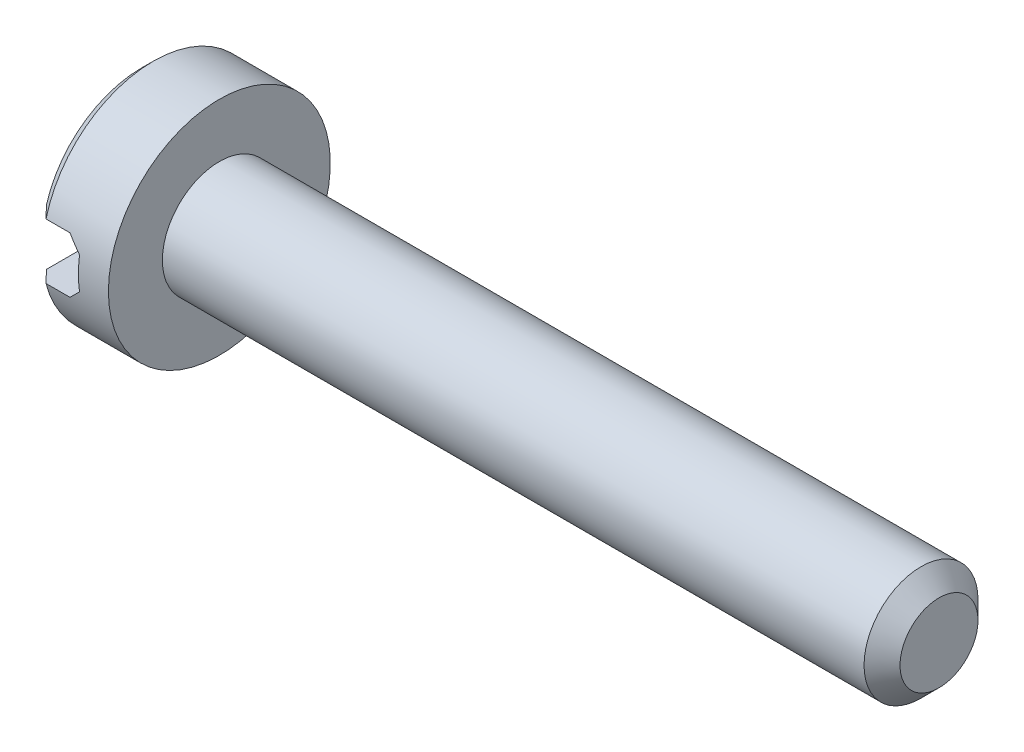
ISO-10303-21;
HEADER;
FILE_DESCRIPTION(('STEP AP214'),'2;1');
FILE_NAME('part.step','',(''),(''),'','','');
FILE_SCHEMA(('AUTOMOTIVE_DESIGN { 1 0 10303 214 1 1 1 1 }'));
ENDSEC;
DATA;
#1=APPLICATION_CONTEXT('core data for automotive mechanical design processes');
#2=APPLICATION_PROTOCOL_DEFINITION('international standard','automotive_design',2000,#1);
#3=PRODUCT_CONTEXT('',#1,'mechanical');
#4=PRODUCT('Part','Part','',(#3));
#5=PRODUCT_RELATED_PRODUCT_CATEGORY('part','',(#4));
#6=PRODUCT_DEFINITION_FORMATION('','',#4);
#7=PRODUCT_DEFINITION_CONTEXT('part definition',#1,'design');
#8=PRODUCT_DEFINITION('design','',#6,#7);
#9=PRODUCT_DEFINITION_SHAPE('','',#8);
#10=(LENGTH_UNIT() NAMED_UNIT(*) SI_UNIT(.MILLI.,.METRE.));
#11=(NAMED_UNIT(*) PLANE_ANGLE_UNIT() SI_UNIT($,.RADIAN.));
#12=(NAMED_UNIT(*) SI_UNIT($,.STERADIAN.) SOLID_ANGLE_UNIT());
#13=UNCERTAINTY_MEASURE_WITH_UNIT(LENGTH_MEASURE(1.E-05),#10,'distance_accuracy_value','');
#14=(GEOMETRIC_REPRESENTATION_CONTEXT(3) GLOBAL_UNCERTAINTY_ASSIGNED_CONTEXT((#13)) GLOBAL_UNIT_ASSIGNED_CONTEXT((#10,
#11,#12)) REPRESENTATION_CONTEXT('',''));
#15=CARTESIAN_POINT('',(0.,0.,0.));
#16=DIRECTION('',(0.,0.,1.));
#17=DIRECTION('',(1.,0.,0.));
#18=AXIS2_PLACEMENT_3D('',#15,#16,#17);
#19=CARTESIAN_POINT('',(1.3,1.85,0.));
#20=DIRECTION('',(-1.,0.,0.));
#21=DIRECTION('',(0.,0.,1.));
#22=AXIS2_PLACEMENT_3D('',#19,#20,#21);
#23=PLANE('',#22);
#24=CARTESIAN_POINT('',(1.3,0.,0.));
#25=DIRECTION('',(-1.,0.,0.));
#26=DIRECTION('',(0.,0.,1.));
#27=AXIS2_PLACEMENT_3D('',#24,#25,#26);
#28=CIRCLE('',#27,1.85);
#29=CARTESIAN_POINT('',(1.3,0.,1.85));
#30=VERTEX_POINT('',#29);
#31=EDGE_CURVE('E111',#30,#30,#28,.T.);
#32=ORIENTED_EDGE('',*,*,#31,.F.);
#33=EDGE_LOOP('',(#32));
#34=FACE_BOUND('',#33,.T.);
#35=CARTESIAN_POINT('',(1.3,0.,0.));
#36=DIRECTION('',(-1.,0.,0.));
#37=DIRECTION('',(0.,0.,1.));
#38=AXIS2_PLACEMENT_3D('',#35,#36,#37);
#39=CIRCLE('',#38,0.95);
#40=CARTESIAN_POINT('',(1.3,0.,0.95));
#41=VERTEX_POINT('',#40);
#42=EDGE_CURVE('E150',#41,#41,#39,.F.);
#43=ORIENTED_EDGE('',*,*,#42,.F.);
#44=EDGE_LOOP('',(#43));
#45=FACE_BOUND('',#44,.T.);
#46=ADVANCED_FACE('F37',(#34,#45),#23,.F.);
#47=CARTESIAN_POINT('',(0.2,0.,0.));
#48=DIRECTION('',(1.,0.,0.));
#49=DIRECTION('',(0.,0.,-1.));
#50=AXIS2_PLACEMENT_3D('',#47,#48,#49);
#51=CONICAL_SURFACE('',#50,1.85,0.785398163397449);
#52=CARTESIAN_POINT('',(0.2,0.,0.));
#53=DIRECTION('',(-1.,0.,0.));
#54=DIRECTION('',(0.,0.,1.));
#55=AXIS2_PLACEMENT_3D('',#52,#53,#54);
#56=CIRCLE('',#55,1.85);
#57=CARTESIAN_POINT('',(0.2,0.465549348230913,1.79046468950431));
#58=VERTEX_POINT('',#57);
#59=CARTESIAN_POINT('',(0.2,0.465549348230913,-1.79046468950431));
#60=VERTEX_POINT('',#59);
#61=EDGE_CURVE('E132',#58,#60,#56,.T.);
#62=ORIENTED_EDGE('',*,*,#61,.T.);
#63=CARTESIAN_POINT('',(2.42344087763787,0.465549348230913,-4.04674985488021));
#64=CARTESIAN_POINT('',(2.31422073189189,0.465549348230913,-3.9368070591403));
#65=CARTESIAN_POINT('',(2.20502763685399,0.465549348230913,-3.82683737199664));
#66=CARTESIAN_POINT('',(1.98669704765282,0.465549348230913,-3.60680197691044));
#67=CARTESIAN_POINT('',(1.87755956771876,0.465549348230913,-3.49673625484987));
#68=CARTESIAN_POINT('',(1.65894933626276,0.465549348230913,-3.27607034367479));
#69=CARTESIAN_POINT('',(1.54947697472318,0.465549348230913,-3.16546976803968));
#70=CARTESIAN_POINT('',(1.33068893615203,0.465549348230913,-2.94415427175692));
#71=CARTESIAN_POINT('',(1.22137323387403,0.465549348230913,-2.83343937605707));
#72=CARTESIAN_POINT('',(0.94158553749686,0.465549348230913,-2.54959909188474));
#73=CARTESIAN_POINT('',(0.771245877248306,0.465549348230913,-2.37634297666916));
#74=CARTESIAN_POINT('',(0.516315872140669,0.465549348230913,-2.11577452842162));
#75=CARTESIAN_POINT('',(0.431406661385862,0.465549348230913,-2.02877427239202));
#76=CARTESIAN_POINT('',(0.261908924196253,0.465549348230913,-1.85447495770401));
#77=CARTESIAN_POINT('',(0.177320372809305,0.465549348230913,-1.76717592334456));
#78=CARTESIAN_POINT('',(0.00893926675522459,0.465549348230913,-1.59244630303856));
#79=CARTESIAN_POINT('',(-0.0748550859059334,0.465549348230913,-1.50501745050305));
#80=CARTESIAN_POINT('',(-0.241707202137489,0.465549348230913,-1.32940591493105));
#81=CARTESIAN_POINT('',(-0.324764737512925,0.465549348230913,-1.24122301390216));
#82=CARTESIAN_POINT('',(-0.448249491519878,0.465549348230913,-1.10803308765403));
#83=CARTESIAN_POINT('',(-0.4892012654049,0.465549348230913,-1.06351303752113));
#84=CARTESIAN_POINT('',(-0.570603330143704,0.465549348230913,-0.974017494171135));
#85=CARTESIAN_POINT('',(-0.61105363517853,0.465549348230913,-0.929042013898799));
#86=CARTESIAN_POINT('',(-0.691196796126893,0.465549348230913,-0.838458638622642));
#87=CARTESIAN_POINT('',(-0.730890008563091,0.465549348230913,-0.792851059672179));
#88=CARTESIAN_POINT('',(-0.809128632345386,0.465549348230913,-0.700664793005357));
#89=CARTESIAN_POINT('',(-0.847674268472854,0.465549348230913,-0.654086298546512));
#90=CARTESIAN_POINT('',(-0.899367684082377,0.465549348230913,-0.588920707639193));
#91=CARTESIAN_POINT('',(-0.913355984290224,0.465549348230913,-0.571002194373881));
#92=CARTESIAN_POINT('',(-0.940978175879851,0.465549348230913,-0.53489334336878));
#93=CARTESIAN_POINT('',(-0.954612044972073,0.465549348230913,-0.516702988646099));
#94=CARTESIAN_POINT('',(-0.994922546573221,0.465549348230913,-0.461548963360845));
#95=CARTESIAN_POINT('',(-1.02093788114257,0.465549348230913,-0.424089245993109));
#96=CARTESIAN_POINT('',(-1.06919063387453,0.465549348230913,-0.348468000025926));
#97=CARTESIAN_POINT('',(-1.09152270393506,0.465549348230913,-0.310367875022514));
#98=CARTESIAN_POINT('',(-1.13109948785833,0.465549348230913,-0.231663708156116));
#99=CARTESIAN_POINT('',(-1.1483700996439,0.465549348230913,-0.191073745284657));
#100=CARTESIAN_POINT('',(-1.16937161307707,0.465549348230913,-0.122137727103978));
#101=CARTESIAN_POINT('',(-1.17573754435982,0.465549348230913,-0.0946292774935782));
#102=CARTESIAN_POINT('',(-1.18362415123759,0.465549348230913,-0.0389959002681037));
#103=CARTESIAN_POINT('',(-1.1851644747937,0.465549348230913,-0.0108739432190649));
#104=CARTESIAN_POINT('',(-1.18310496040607,0.465549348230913,0.0451823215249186));
#105=CARTESIAN_POINT('',(-1.17950248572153,0.465549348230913,0.0731165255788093));
#106=CARTESIAN_POINT('',(-1.16789735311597,0.465549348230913,0.128135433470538));
#107=CARTESIAN_POINT('',(-1.15987428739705,0.465549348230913,0.155215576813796));
#108=CARTESIAN_POINT('',(-1.13863829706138,0.465549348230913,0.213647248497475));
#109=CARTESIAN_POINT('',(-1.12469509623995,0.465549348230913,0.244723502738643));
#110=CARTESIAN_POINT('',(-1.09383840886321,0.465549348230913,0.305390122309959));
#111=CARTESIAN_POINT('',(-1.07691840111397,0.465549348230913,0.334977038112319));
#112=CARTESIAN_POINT('',(-1.04106417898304,0.465549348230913,0.393185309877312));
#113=CARTESIAN_POINT('',(-1.02211606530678,0.465549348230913,0.421797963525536));
#114=CARTESIAN_POINT('',(-0.982981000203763,0.465549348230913,0.478106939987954));
#115=CARTESIAN_POINT('',(-0.962795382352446,0.465549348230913,0.505804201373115));
#116=CARTESIAN_POINT('',(-0.919274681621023,0.465549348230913,0.563580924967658));
#117=CARTESIAN_POINT('',(-0.895838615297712,0.465549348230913,0.593583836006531));
#118=CARTESIAN_POINT('',(-0.848230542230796,0.465549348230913,0.65300190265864));
#119=CARTESIAN_POINT('',(-0.82405844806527,0.465549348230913,0.682416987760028));
#120=CARTESIAN_POINT('',(-0.750747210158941,0.465549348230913,0.770035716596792));
#121=CARTESIAN_POINT('',(-0.700832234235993,0.465549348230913,0.827588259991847));
#122=CARTESIAN_POINT('',(-0.599780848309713,0.465549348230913,0.941762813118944));
#123=CARTESIAN_POINT('',(-0.548642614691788,0.465549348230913,0.998383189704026));
#124=CARTESIAN_POINT('',(-0.445660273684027,0.465549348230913,1.11095186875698));
#125=CARTESIAN_POINT('',(-0.393816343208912,0.465549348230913,1.16690033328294));
#126=CARTESIAN_POINT('',(-0.289869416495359,0.465549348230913,1.27812634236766));
#127=CARTESIAN_POINT('',(-0.237768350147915,0.465549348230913,1.33340569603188));
#128=CARTESIAN_POINT('',(-0.133235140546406,0.465549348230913,1.44365673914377));
#129=CARTESIAN_POINT('',(-0.0808029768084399,0.465549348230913,1.49862840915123));
#130=CARTESIAN_POINT('',(0.0767523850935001,0.465549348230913,1.66311055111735));
#131=CARTESIAN_POINT('',(0.182225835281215,0.465549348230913,1.77228519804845));
#132=CARTESIAN_POINT('',(0.46430719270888,0.465549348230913,2.06287985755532));
#133=CARTESIAN_POINT('',(0.641375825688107,0.465549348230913,2.24385154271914));
#134=CARTESIAN_POINT('',(0.996250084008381,0.465549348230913,2.60519009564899));
#135=CARTESIAN_POINT('',(1.17405593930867,0.465549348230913,2.7855567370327));
#136=CARTESIAN_POINT('',(1.53035733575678,0.465549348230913,3.14622495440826));
#137=CARTESIAN_POINT('',(1.70885353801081,0.465549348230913,3.32652587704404));
#138=CARTESIAN_POINT('',(2.06602855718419,0.465549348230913,3.68681939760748));
#139=CARTESIAN_POINT('',(2.24470728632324,0.465549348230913,3.86681208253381));
#140=CARTESIAN_POINT('',(2.42344087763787,0.465549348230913,4.04674985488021));
#141=B_SPLINE_CURVE_WITH_KNOTS('',3,(#63,#64,#65,#66,#67,#68,#69,#70,#71,#72,#73,#74,#75,#76,
#77,#78,#79,#80,#81,#82,#83,#84,#85,#86,#87,#88,#89,#90,#91,#92,#93,#94,#95,#96,#97,#98,#99,
#100,#101,#102,#103,#104,#105,#106,#107,#108,#109,#110,#111,#112,#113,#114,#115,#116,#117,#118,
#119,#120,#121,#122,#123,#124,#125,#126,#127,#128,#129,#130,#131,#132,#133,#134,#135,#136,#137,
#138,#139,#140),.UNSPECIFIED.,.F.,.F.,(4,2,2,2,2,2,2,2,2,2,2,2,2,2,2,2,2,2,2,2,2,2,2,2,2,2,2,2,
2,2,2,2,2,2,2,2,2,2,4),(0.,0.46491734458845,0.929921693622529,1.39677290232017,1.86353771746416,
2.59243863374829,2.95714021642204,3.32181281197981,3.68511212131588,4.04852027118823,
4.22998896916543,4.41145252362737,4.59282840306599,4.77416851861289,4.84236041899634,
4.91055659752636,5.04728388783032,5.17961007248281,5.31124686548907,5.39561130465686,
5.47963179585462,5.56369538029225,5.64815033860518,5.75007643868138,5.85222867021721,
5.95513223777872,6.05792679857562,6.17212384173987,6.28633450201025,6.51484917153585,
6.74372884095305,6.97255215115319,7.20043854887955,7.42833918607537,7.88374058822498,
8.64329990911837,9.40311729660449,10.1642502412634,10.9251118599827),.UNSPECIFIED.);
#142=CARTESIAN_POINT('',(0.,0.465549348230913,-1.58296045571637));
#143=VERTEX_POINT('',#142);
#144=EDGE_CURVE('E128',#60,#143,#141,.T.);
#145=ORIENTED_EDGE('',*,*,#144,.T.);
#146=CARTESIAN_POINT('',(0.,0.,0.));
#147=DIRECTION('',(-1.,0.,0.));
#148=DIRECTION('',(0.,0.,1.));
#149=AXIS2_PLACEMENT_3D('',#146,#147,#148);
#150=CIRCLE('',#149,1.65);
#151=CARTESIAN_POINT('',(0.,0.465549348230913,1.58296045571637));
#152=VERTEX_POINT('',#151);
#153=EDGE_CURVE('E123',#152,#143,#150,.T.);
#154=ORIENTED_EDGE('',*,*,#153,.F.);
#155=EDGE_CURVE('E191',#152,#58,#141,.T.);
#156=ORIENTED_EDGE('',*,*,#155,.T.);
#157=EDGE_LOOP('',(#62,#145,#154,#156));
#158=FACE_BOUND('',#157,.T.);
#159=ADVANCED_FACE('F166',(#158),#51,.T.);
#160=CARTESIAN_POINT('',(0.,0.,0.));
#161=DIRECTION('',(1.,0.,0.));
#162=DIRECTION('',(0.,0.,-1.));
#163=AXIS2_PLACEMENT_3D('',#160,#161,#162);
#164=PLANE('',#163);
#165=ORIENTED_EDGE('',*,*,#153,.T.);
#166=DIRECTION('',(0.,0.,1.));
#167=VECTOR('',#166,1.);
#168=CARTESIAN_POINT('',(0.,0.465549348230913,0.));
#169=LINE('',#168,#167);
#170=EDGE_CURVE('E110',#143,#152,#169,.T.);
#171=ORIENTED_EDGE('',*,*,#170,.T.);
#172=EDGE_LOOP('',(#165,#171));
#173=FACE_BOUND('',#172,.T.);
#174=ADVANCED_FACE('F171',(#173),#164,.F.);
#175=CARTESIAN_POINT('',(0.,0.,0.));
#176=DIRECTION('',(-1.,0.,0.));
#177=DIRECTION('',(0.,0.,1.));
#178=AXIS2_PLACEMENT_3D('',#175,#176,#177);
#179=CYLINDRICAL_SURFACE('',#178,1.85);
#180=ORIENTED_EDGE('',*,*,#61,.F.);
#181=DIRECTION('',(-1.,0.,0.));
#182=VECTOR('',#181,1.);
#183=CARTESIAN_POINT('',(0.,0.465549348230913,1.79046468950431));
#184=LINE('',#183,#182);
#185=CARTESIAN_POINT('',(0.6,0.465549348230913,1.79046468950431));
#186=VERTEX_POINT('',#185);
#187=EDGE_CURVE('E198',#58,#186,#184,.F.);
#188=ORIENTED_EDGE('',*,*,#187,.T.);
#189=CARTESIAN_POINT('',(1.06554934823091,0.,0.));
#190=DIRECTION('',(0.707106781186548,0.707106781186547,0.));
#191=DIRECTION('',(-0.707106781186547,0.707106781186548,0.));
#192=AXIS2_PLACEMENT_3D('',#189,#190,#191);
#193=ELLIPSE('',#192,2.61629509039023,1.85);
#194=CARTESIAN_POINT('',(0.8,0.265549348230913,1.83084230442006));
#195=VERTEX_POINT('',#194);
#196=EDGE_CURVE('E149',#186,#195,#193,.T.);
#197=ORIENTED_EDGE('',*,*,#196,.T.);
#198=CARTESIAN_POINT('',(0.8,0.,0.));
#199=DIRECTION('',(1.,0.,0.));
#200=DIRECTION('',(0.,0.,-1.));
#201=AXIS2_PLACEMENT_3D('',#198,#199,#200);
#202=CIRCLE('',#201,1.85);
#203=CARTESIAN_POINT('',(0.8,-0.265549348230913,1.83084230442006));
#204=VERTEX_POINT('',#203);
#205=EDGE_CURVE('E60',#195,#204,#202,.T.);
#206=ORIENTED_EDGE('',*,*,#205,.T.);
#207=CARTESIAN_POINT('',(1.06554934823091,0.,0.));
#208=DIRECTION('',(0.707106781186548,-0.707106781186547,0.));
#209=DIRECTION('',(-0.707106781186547,-0.707106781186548,0.));
#210=AXIS2_PLACEMENT_3D('',#207,#208,#209);
#211=ELLIPSE('',#210,2.61629509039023,1.85);
#212=CARTESIAN_POINT('',(0.6,-0.465549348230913,1.79046468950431));
#213=VERTEX_POINT('',#212);
#214=EDGE_CURVE('E143',#204,#213,#211,.T.);
#215=ORIENTED_EDGE('',*,*,#214,.T.);
#216=DIRECTION('',(-1.,0.,0.));
#217=VECTOR('',#216,1.);
#218=CARTESIAN_POINT('',(0.,-0.465549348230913,1.79046468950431));
#219=LINE('',#218,#217);
#220=CARTESIAN_POINT('',(0.2,-0.465549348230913,1.79046468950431));
#221=VERTEX_POINT('',#220);
#222=EDGE_CURVE('E119',#213,#221,#219,.T.);
#223=ORIENTED_EDGE('',*,*,#222,.T.);
#224=CARTESIAN_POINT('',(0.2,-0.465549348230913,-1.79046468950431));
#225=VERTEX_POINT('',#224);
#226=EDGE_CURVE('E118',#225,#221,#56,.T.);
#227=ORIENTED_EDGE('',*,*,#226,.F.);
#228=DIRECTION('',(-1.,0.,0.));
#229=VECTOR('',#228,1.);
#230=CARTESIAN_POINT('',(0.,-0.465549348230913,-1.79046468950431));
#231=LINE('',#230,#229);
#232=CARTESIAN_POINT('',(0.6,-0.465549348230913,-1.79046468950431));
#233=VERTEX_POINT('',#232);
#234=EDGE_CURVE('E120',#225,#233,#231,.F.);
#235=ORIENTED_EDGE('',*,*,#234,.T.);
#236=CARTESIAN_POINT('',(0.8,-0.265549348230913,-1.83084230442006));
#237=VERTEX_POINT('',#236);
#238=EDGE_CURVE('E139',#233,#237,#211,.T.);
#239=ORIENTED_EDGE('',*,*,#238,.T.);
#240=CARTESIAN_POINT('',(0.8,0.265549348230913,-1.83084230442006));
#241=VERTEX_POINT('',#240);
#242=EDGE_CURVE('E142',#237,#241,#202,.T.);
#243=ORIENTED_EDGE('',*,*,#242,.T.);
#244=CARTESIAN_POINT('',(0.6,0.465549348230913,-1.79046468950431));
#245=VERTEX_POINT('',#244);
#246=EDGE_CURVE('E146',#241,#245,#193,.T.);
#247=ORIENTED_EDGE('',*,*,#246,.T.);
#248=DIRECTION('',(-1.,0.,0.));
#249=VECTOR('',#248,1.);
#250=CARTESIAN_POINT('',(0.,0.465549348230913,-1.79046468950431));
#251=LINE('',#250,#249);
#252=EDGE_CURVE('E124',#245,#60,#251,.T.);
#253=ORIENTED_EDGE('',*,*,#252,.T.);
#254=EDGE_LOOP('',(#180,#188,#197,#206,#215,#223,#227,#235,#239,#243,#247,#253));
#255=FACE_BOUND('',#254,.T.);
#256=ORIENTED_EDGE('',*,*,#31,.T.);
#257=EDGE_LOOP('',(#256));
#258=FACE_BOUND('',#257,.T.);
#259=ADVANCED_FACE('F177',(#255,#258),#179,.T.);
#260=ORIENTED_EDGE('',*,*,#226,.T.);
#261=CARTESIAN_POINT('',(2.42344087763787,-0.465549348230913,4.0467498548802));
#262=CARTESIAN_POINT('',(2.31422073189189,-0.465549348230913,3.9368070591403));
#263=CARTESIAN_POINT('',(2.20502763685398,-0.465549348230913,3.82683737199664));
#264=CARTESIAN_POINT('',(1.98669704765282,-0.465549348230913,3.60680197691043));
#265=CARTESIAN_POINT('',(1.87755956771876,-0.465549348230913,3.49673625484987));
#266=CARTESIAN_POINT('',(1.65894933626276,-0.465549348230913,3.27607034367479));
#267=CARTESIAN_POINT('',(1.54947697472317,-0.465549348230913,3.16546976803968));
#268=CARTESIAN_POINT('',(1.33068893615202,-0.465549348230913,2.94415427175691));
#269=CARTESIAN_POINT('',(1.22137323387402,-0.465549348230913,2.83343937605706));
#270=CARTESIAN_POINT('',(0.941585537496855,-0.465549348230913,2.54959909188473));
#271=CARTESIAN_POINT('',(0.771245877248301,-0.465549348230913,2.37634297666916));
#272=CARTESIAN_POINT('',(0.516315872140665,-0.465549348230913,2.11577452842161));
#273=CARTESIAN_POINT('',(0.431406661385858,-0.465549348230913,2.02877427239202));
#274=CARTESIAN_POINT('',(0.261908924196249,-0.465549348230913,1.85447495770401));
#275=CARTESIAN_POINT('',(0.177320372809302,-0.465549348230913,1.76717592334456));
#276=CARTESIAN_POINT('',(0.00893926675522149,-0.465549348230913,1.59244630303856));
#277=CARTESIAN_POINT('',(-0.0748550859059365,-0.465549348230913,1.50501745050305));
#278=CARTESIAN_POINT('',(-0.241707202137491,-0.465549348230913,1.32940591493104));
#279=CARTESIAN_POINT('',(-0.324764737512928,-0.465549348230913,1.24122301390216));
#280=CARTESIAN_POINT('',(-0.44824949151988,-0.465549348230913,1.10803308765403));
#281=CARTESIAN_POINT('',(-0.489201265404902,-0.465549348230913,1.06351303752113));
#282=CARTESIAN_POINT('',(-0.570603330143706,-0.465549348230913,0.974017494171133));
#283=CARTESIAN_POINT('',(-0.611053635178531,-0.465549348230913,0.929042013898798));
#284=CARTESIAN_POINT('',(-0.691196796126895,-0.465549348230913,0.83845863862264));
#285=CARTESIAN_POINT('',(-0.730890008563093,-0.465549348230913,0.792851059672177));
#286=CARTESIAN_POINT('',(-0.809128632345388,-0.465549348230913,0.700664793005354));
#287=CARTESIAN_POINT('',(-0.847674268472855,-0.465549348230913,0.65408629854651));
#288=CARTESIAN_POINT('',(-0.899367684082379,-0.465549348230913,0.588920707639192));
#289=CARTESIAN_POINT('',(-0.913355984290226,-0.465549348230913,0.571002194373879));
#290=CARTESIAN_POINT('',(-0.940978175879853,-0.465549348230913,0.534893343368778));
#291=CARTESIAN_POINT('',(-0.954612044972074,-0.465549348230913,0.516702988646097));
#292=CARTESIAN_POINT('',(-0.994922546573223,-0.465549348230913,0.461548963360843));
#293=CARTESIAN_POINT('',(-1.02093788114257,-0.465549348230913,0.424089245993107));
#294=CARTESIAN_POINT('',(-1.06919063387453,-0.465549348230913,0.348468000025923));
#295=CARTESIAN_POINT('',(-1.09152270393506,-0.465549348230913,0.310367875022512));
#296=CARTESIAN_POINT('',(-1.13109948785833,-0.465549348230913,0.231663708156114));
#297=CARTESIAN_POINT('',(-1.1483700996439,-0.465549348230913,0.191073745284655));
#298=CARTESIAN_POINT('',(-1.16937161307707,-0.465549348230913,0.122137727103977));
#299=CARTESIAN_POINT('',(-1.17573754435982,-0.465549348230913,0.0946292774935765));
#300=CARTESIAN_POINT('',(-1.18362415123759,-0.465549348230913,0.0389959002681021));
#301=CARTESIAN_POINT('',(-1.1851644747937,-0.465549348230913,0.0108739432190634));
#302=CARTESIAN_POINT('',(-1.18310496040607,-0.465549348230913,-0.0451823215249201));
#303=CARTESIAN_POINT('',(-1.17950248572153,-0.465549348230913,-0.0731165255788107));
#304=CARTESIAN_POINT('',(-1.16789735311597,-0.465549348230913,-0.128135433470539));
#305=CARTESIAN_POINT('',(-1.15987428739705,-0.465549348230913,-0.155215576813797));
#306=CARTESIAN_POINT('',(-1.13863829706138,-0.465549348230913,-0.213647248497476));
#307=CARTESIAN_POINT('',(-1.12469509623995,-0.465549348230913,-0.244723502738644));
#308=CARTESIAN_POINT('',(-1.09383840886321,-0.465549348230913,-0.305390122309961));
#309=CARTESIAN_POINT('',(-1.07691840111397,-0.465549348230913,-0.334977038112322));
#310=CARTESIAN_POINT('',(-1.04106417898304,-0.465549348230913,-0.393185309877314));
#311=CARTESIAN_POINT('',(-1.02211606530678,-0.465549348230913,-0.421797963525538));
#312=CARTESIAN_POINT('',(-0.982981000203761,-0.465549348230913,-0.478106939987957));
#313=CARTESIAN_POINT('',(-0.962795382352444,-0.465549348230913,-0.505804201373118));
#314=CARTESIAN_POINT('',(-0.919274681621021,-0.465549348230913,-0.563580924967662));
#315=CARTESIAN_POINT('',(-0.895838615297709,-0.465549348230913,-0.593583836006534));
#316=CARTESIAN_POINT('',(-0.848230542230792,-0.465549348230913,-0.653001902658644));
#317=CARTESIAN_POINT('',(-0.824058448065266,-0.465549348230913,-0.682416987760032));
#318=CARTESIAN_POINT('',(-0.750747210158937,-0.465549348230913,-0.770035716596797));
#319=CARTESIAN_POINT('',(-0.700832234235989,-0.465549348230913,-0.827588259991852));
#320=CARTESIAN_POINT('',(-0.599780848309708,-0.465549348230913,-0.941762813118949));
#321=CARTESIAN_POINT('',(-0.548642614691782,-0.465549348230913,-0.998383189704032));
#322=CARTESIAN_POINT('',(-0.44566027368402,-0.465549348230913,-1.11095186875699));
#323=CARTESIAN_POINT('',(-0.393816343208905,-0.465549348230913,-1.16690033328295));
#324=CARTESIAN_POINT('',(-0.289869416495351,-0.465549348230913,-1.27812634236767));
#325=CARTESIAN_POINT('',(-0.237768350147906,-0.465549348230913,-1.33340569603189));
#326=CARTESIAN_POINT('',(-0.133235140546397,-0.465549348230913,-1.44365673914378));
#327=CARTESIAN_POINT('',(-0.0808029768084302,-0.465549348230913,-1.49862840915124));
#328=CARTESIAN_POINT('',(0.0767523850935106,-0.465549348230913,-1.66311055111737));
#329=CARTESIAN_POINT('',(0.182225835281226,-0.465549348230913,-1.77228519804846));
#330=CARTESIAN_POINT('',(0.464307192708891,-0.465549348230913,-2.06287985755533));
#331=CARTESIAN_POINT('',(0.641375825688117,-0.465549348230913,-2.24385154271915));
#332=CARTESIAN_POINT('',(0.996250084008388,-0.465549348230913,-2.605190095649));
#333=CARTESIAN_POINT('',(1.17405593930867,-0.465549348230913,-2.7855567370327));
#334=CARTESIAN_POINT('',(1.53035733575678,-0.465549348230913,-3.14622495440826));
#335=CARTESIAN_POINT('',(1.70885353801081,-0.465549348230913,-3.32652587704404));
#336=CARTESIAN_POINT('',(2.06602855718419,-0.465549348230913,-3.68681939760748));
#337=CARTESIAN_POINT('',(2.24470728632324,-0.465549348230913,-3.86681208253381));
#338=CARTESIAN_POINT('',(2.42344087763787,-0.465549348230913,-4.0467498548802));
#339=B_SPLINE_CURVE_WITH_KNOTS('',3,(#261,#262,#263,#264,#265,#266,#267,#268,#269,#270,#271,
#272,#273,#274,#275,#276,#277,#278,#279,#280,#281,#282,#283,#284,#285,#286,#287,#288,#289,#290,
#291,#292,#293,#294,#295,#296,#297,#298,#299,#300,#301,#302,#303,#304,#305,#306,#307,#308,#309,
#310,#311,#312,#313,#314,#315,#316,#317,#318,#319,#320,#321,#322,#323,#324,#325,#326,#327,#328,
#329,#330,#331,#332,#333,#334,#335,#336,#337,#338),.UNSPECIFIED.,.F.,.F.,(4,2,2,2,2,2,2,2,2,2,2,
2,2,2,2,2,2,2,2,2,2,2,2,2,2,2,2,2,2,2,2,2,2,2,2,2,2,2,4),(0.,0.46491734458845,0.929921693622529,
1.39677290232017,1.86353771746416,2.59243863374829,2.95714021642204,3.32181281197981,
3.68511212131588,4.04852027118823,4.22998896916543,4.41145252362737,4.59282840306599,
4.77416851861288,4.84236041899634,4.91055659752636,5.04728388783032,5.1796100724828,
5.31124686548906,5.39561130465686,5.47963179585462,5.56369538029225,5.64815033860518,
5.75007643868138,5.85222867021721,5.95513223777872,6.05792679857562,6.17212384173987,
6.28633450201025,6.51484917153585,6.74372884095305,6.97255215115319,7.20043854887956,
7.42833918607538,7.883740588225,8.64329990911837,9.40311729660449,10.1642502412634,
10.9251118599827),.UNSPECIFIED.);
#340=CARTESIAN_POINT('',(0.,-0.465549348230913,1.58296045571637));
#341=VERTEX_POINT('',#340);
#342=EDGE_CURVE('E105',#221,#341,#339,.T.);
#343=ORIENTED_EDGE('',*,*,#342,.T.);
#344=CARTESIAN_POINT('',(0.,-0.465549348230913,-1.58296045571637));
#345=VERTEX_POINT('',#344);
#346=EDGE_CURVE('E116',#345,#341,#150,.T.);
#347=ORIENTED_EDGE('',*,*,#346,.F.);
#348=EDGE_CURVE('E52',#345,#225,#339,.T.);
#349=ORIENTED_EDGE('',*,*,#348,.T.);
#350=EDGE_LOOP('',(#260,#343,#347,#349));
#351=FACE_BOUND('',#350,.T.);
#352=ADVANCED_FACE('F115',(#351),#51,.T.);
#353=ORIENTED_EDGE('',*,*,#346,.T.);
#354=DIRECTION('',(0.,0.,-1.));
#355=VECTOR('',#354,1.);
#356=CARTESIAN_POINT('',(0.,-0.465549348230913,0.));
#357=LINE('',#356,#355);
#358=EDGE_CURVE('E101',#341,#345,#357,.T.);
#359=ORIENTED_EDGE('',*,*,#358,.T.);
#360=EDGE_LOOP('',(#353,#359));
#361=FACE_BOUND('',#360,.T.);
#362=ADVANCED_FACE('F122',(#361),#164,.F.);
#363=CARTESIAN_POINT('',(0.6,0.465549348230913,-5.));
#364=DIRECTION('',(0.707106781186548,0.707106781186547,0.));
#365=DIRECTION('',(-0.707106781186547,0.707106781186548,0.));
#366=AXIS2_PLACEMENT_3D('',#363,#364,#365);
#367=PLANE('',#366);
#368=DIRECTION('',(0.,0.,1.));
#369=VECTOR('',#368,1.);
#370=CARTESIAN_POINT('',(0.6,0.465549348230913,-5.));
#371=LINE('',#370,#369);
#372=EDGE_CURVE('E312',#245,#186,#371,.T.);
#373=ORIENTED_EDGE('',*,*,#372,.F.);
#374=ORIENTED_EDGE('',*,*,#246,.F.);
#375=DIRECTION('',(0.,0.,1.));
#376=VECTOR('',#375,1.);
#377=CARTESIAN_POINT('',(0.8,0.265549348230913,-5.));
#378=LINE('',#377,#376);
#379=EDGE_CURVE('E313',#241,#195,#378,.T.);
#380=ORIENTED_EDGE('',*,*,#379,.T.);
#381=ORIENTED_EDGE('',*,*,#196,.F.);
#382=EDGE_LOOP('',(#373,#374,#380,#381));
#383=FACE_BOUND('',#382,.T.);
#384=ADVANCED_FACE('F206',(#383),#367,.F.);
#385=CARTESIAN_POINT('',(0.8,0.265549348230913,-5.));
#386=DIRECTION('',(1.,0.,0.));
#387=DIRECTION('',(0.,0.,-1.));
#388=AXIS2_PLACEMENT_3D('',#385,#386,#387);
#389=PLANE('',#388);
#390=ORIENTED_EDGE('',*,*,#379,.F.);
#391=ORIENTED_EDGE('',*,*,#242,.F.);
#392=DIRECTION('',(0.,0.,1.));
#393=VECTOR('',#392,1.);
#394=CARTESIAN_POINT('',(0.8,-0.265549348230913,-5.));
#395=LINE('',#394,#393);
#396=EDGE_CURVE('E315',#237,#204,#395,.T.);
#397=ORIENTED_EDGE('',*,*,#396,.T.);
#398=ORIENTED_EDGE('',*,*,#205,.F.);
#399=EDGE_LOOP('',(#390,#391,#397,#398));
#400=FACE_BOUND('',#399,.T.);
#401=ADVANCED_FACE('F209',(#400),#389,.F.);
#402=CARTESIAN_POINT('',(0.6,-0.465549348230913,-5.));
#403=DIRECTION('',(0.707106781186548,-0.707106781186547,0.));
#404=DIRECTION('',(0.707106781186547,0.707106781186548,0.));
#405=AXIS2_PLACEMENT_3D('',#402,#403,#404);
#406=PLANE('',#405);
#407=DIRECTION('',(0.,0.,1.));
#408=VECTOR('',#407,1.);
#409=CARTESIAN_POINT('',(0.6,-0.465549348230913,-5.));
#410=LINE('',#409,#408);
#411=EDGE_CURVE('E318',#233,#213,#410,.T.);
#412=ORIENTED_EDGE('',*,*,#411,.T.);
#413=ORIENTED_EDGE('',*,*,#214,.F.);
#414=ORIENTED_EDGE('',*,*,#396,.F.);
#415=ORIENTED_EDGE('',*,*,#238,.F.);
#416=EDGE_LOOP('',(#412,#413,#414,#415));
#417=FACE_BOUND('',#416,.T.);
#418=ADVANCED_FACE('F204',(#417),#406,.F.);
#419=CARTESIAN_POINT('',(0.,0.465549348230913,-5.));
#420=DIRECTION('',(0.,1.,0.));
#421=DIRECTION('',(0.,0.,1.));
#422=AXIS2_PLACEMENT_3D('',#419,#420,#421);
#423=PLANE('',#422);
#424=ORIENTED_EDGE('',*,*,#372,.T.);
#425=ORIENTED_EDGE('',*,*,#187,.F.);
#426=ORIENTED_EDGE('',*,*,#155,.F.);
#427=ORIENTED_EDGE('',*,*,#170,.F.);
#428=ORIENTED_EDGE('',*,*,#144,.F.);
#429=ORIENTED_EDGE('',*,*,#252,.F.);
#430=EDGE_LOOP('',(#424,#425,#426,#427,#428,#429));
#431=FACE_BOUND('',#430,.T.);
#432=ADVANCED_FACE('F199',(#431),#423,.F.);
#433=CARTESIAN_POINT('',(0.,-0.465549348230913,-5.));
#434=DIRECTION('',(0.,-1.,0.));
#435=DIRECTION('',(0.,0.,-1.));
#436=AXIS2_PLACEMENT_3D('',#433,#434,#435);
#437=PLANE('',#436);
#438=ORIENTED_EDGE('',*,*,#411,.F.);
#439=ORIENTED_EDGE('',*,*,#234,.F.);
#440=ORIENTED_EDGE('',*,*,#348,.F.);
#441=ORIENTED_EDGE('',*,*,#358,.F.);
#442=ORIENTED_EDGE('',*,*,#342,.F.);
#443=ORIENTED_EDGE('',*,*,#222,.F.);
#444=EDGE_LOOP('',(#438,#439,#440,#441,#442,#443));
#445=FACE_BOUND('',#444,.T.);
#446=ADVANCED_FACE('F104',(#445),#437,.F.);
#447=CARTESIAN_POINT('',(13.3,0.,0.));
#448=DIRECTION('',(-1.,0.,0.));
#449=DIRECTION('',(0.,0.,1.));
#450=AXIS2_PLACEMENT_3D('',#447,#448,#449);
#451=CYLINDRICAL_SURFACE('',#450,0.95);
#452=CARTESIAN_POINT('',(13.,0.,0.));
#453=DIRECTION('',(1.,0.,0.));
#454=DIRECTION('',(0.,0.,-1.));
#455=AXIS2_PLACEMENT_3D('',#452,#453,#454);
#456=CIRCLE('',#455,0.95);
#457=CARTESIAN_POINT('',(13.,0.,-0.95));
#458=VERTEX_POINT('',#457);
#459=EDGE_CURVE('E11',#458,#458,#456,.F.);
#460=ORIENTED_EDGE('',*,*,#459,.T.);
#461=EDGE_LOOP('',(#460));
#462=FACE_BOUND('',#461,.T.);
#463=ORIENTED_EDGE('',*,*,#42,.T.);
#464=EDGE_LOOP('',(#463));
#465=FACE_BOUND('',#464,.T.);
#466=ADVANCED_FACE('F162',(#462,#465),#451,.T.);
#467=CARTESIAN_POINT('',(13.3,0.,0.));
#468=DIRECTION('',(1.,0.,0.));
#469=DIRECTION('',(0.,0.,-1.));
#470=AXIS2_PLACEMENT_3D('',#467,#468,#469);
#471=PLANE('',#470);
#472=CARTESIAN_POINT('',(13.3,0.,0.));
#473=DIRECTION('',(1.,0.,0.));
#474=DIRECTION('',(0.,0.,-1.));
#475=AXIS2_PLACEMENT_3D('',#472,#473,#474);
#476=CIRCLE('',#475,0.650000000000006);
#477=CARTESIAN_POINT('',(13.3,0.,-0.650000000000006));
#478=VERTEX_POINT('',#477);
#479=EDGE_CURVE('E45',#478,#478,#476,.T.);
#480=ORIENTED_EDGE('',*,*,#479,.T.);
#481=EDGE_LOOP('',(#480));
#482=FACE_BOUND('',#481,.T.);
#483=ADVANCED_FACE('F155',(#482),#471,.T.);
#484=CARTESIAN_POINT('',(13.3,0.,0.));
#485=DIRECTION('',(-1.,0.,0.));
#486=DIRECTION('',(0.,0.,1.));
#487=AXIS2_PLACEMENT_3D('',#484,#485,#486);
#488=CONICAL_SURFACE('',#487,0.650000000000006,0.785398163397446);
#489=ORIENTED_EDGE('',*,*,#459,.F.);
#490=EDGE_LOOP('',(#489));
#491=FACE_BOUND('',#490,.T.);
#492=ORIENTED_EDGE('',*,*,#479,.F.);
#493=EDGE_LOOP('',(#492));
#494=FACE_BOUND('',#493,.T.);
#495=ADVANCED_FACE('F39',(#491,#494),#488,.T.);
#496=CLOSED_SHELL('',(#46,#159,#174,#259,#352,#362,#384,#401,#418,#432,#446,#466,#483,#495));
#497=MANIFOLD_SOLID_BREP('B2',#496);
#498=ADVANCED_BREP_SHAPE_REPRESENTATION('',(#18,#497),#14);
#499=SHAPE_DEFINITION_REPRESENTATION(#9,#498);
ENDSEC;
END-ISO-10303-21;
